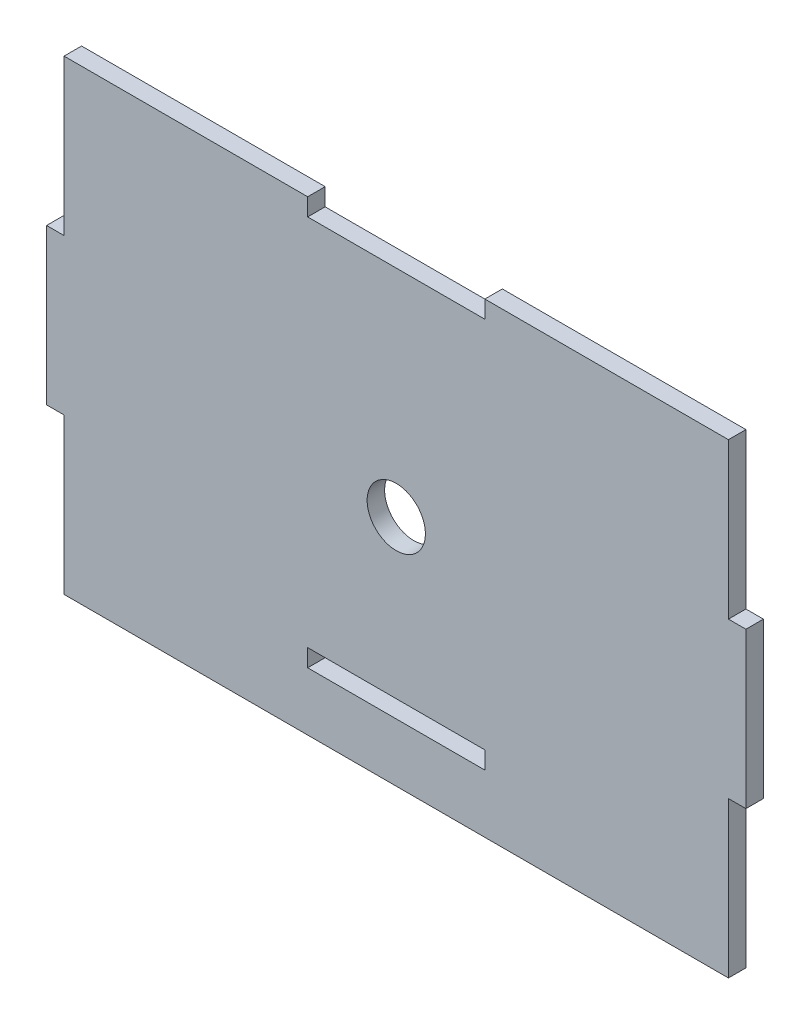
from build123d import *

# Parameters (mm, degrees)
SKETCH1_W           = 120
SKETCH1_H           = 80
BOSS_EXTRUDE1_DEPTH = 3
SKETCH2_W           = 30.4
SKETCH2_H           = 3
CUT_EXTRUDE1_DEPTH  = 3
SKETCH3_W           = 3
SKETCH3_H           = 26.666666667
CUT_EXTRUDE2_DEPTH  = 3
LPATTERN1_COUNT     = 2
LPATTERN1_PITCH     = 67
SKETCH4_R           = 5
CUT_EXTRUDE3_DEPTH  = 10


with BuildPart() as part:
    # Sketch1 → Boss-Extrude1 (new body)
    with BuildSketch(Plane.XY):
        Rectangle(SKETCH1_W, SKETCH1_H)
    extrude(amount=BOSS_EXTRUDE1_DEPTH)

    # Sketch2 → Cut-Extrude1 (cut)
    with BuildSketch(Plane.XY.offset(3)):
        with Locations((0, -28.5)):
            Rectangle(SKETCH2_W, SKETCH2_H)
    cut_extrude1 = extrude(amount=-CUT_EXTRUDE1_DEPTH, mode=Mode.SUBTRACT)

    # Sketch3 → Cut-Extrude2 (cut)
    with BuildSketch(Plane.XY.offset(3)):
        with Locations((-58.5, 26.666666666)):
            Rectangle(SKETCH3_W, SKETCH3_H)
        with Locations((-58.5, -26.666666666)):
            Rectangle(SKETCH3_W, SKETCH3_H)
    cut_extrude2 = extrude(amount=-CUT_EXTRUDE2_DEPTH, mode=Mode.SUBTRACT)

    # Mirror1: Cut-Extrude2 across plane
    add(cut_extrude2.mirror(Plane(origin=(0, 0, 0), x_dir=(0, 0, 1), z_dir=(1, 0, 0))), mode=Mode.SUBTRACT)

    # LPattern1: Cut-Extrude1 ×2
    with Locations(*[(0, i * LPATTERN1_PITCH, 0) for i in range(1, LPATTERN1_COUNT)]):
        add(cut_extrude1, mode=Mode.SUBTRACT)

    # Sketch4 → Cut-Extrude3 (cut)
    with BuildSketch(Plane.XY.offset(3)):
        Circle(SKETCH4_R)
    extrude(amount=-CUT_EXTRUDE3_DEPTH, mode=Mode.SUBTRACT)


solid = part.part
